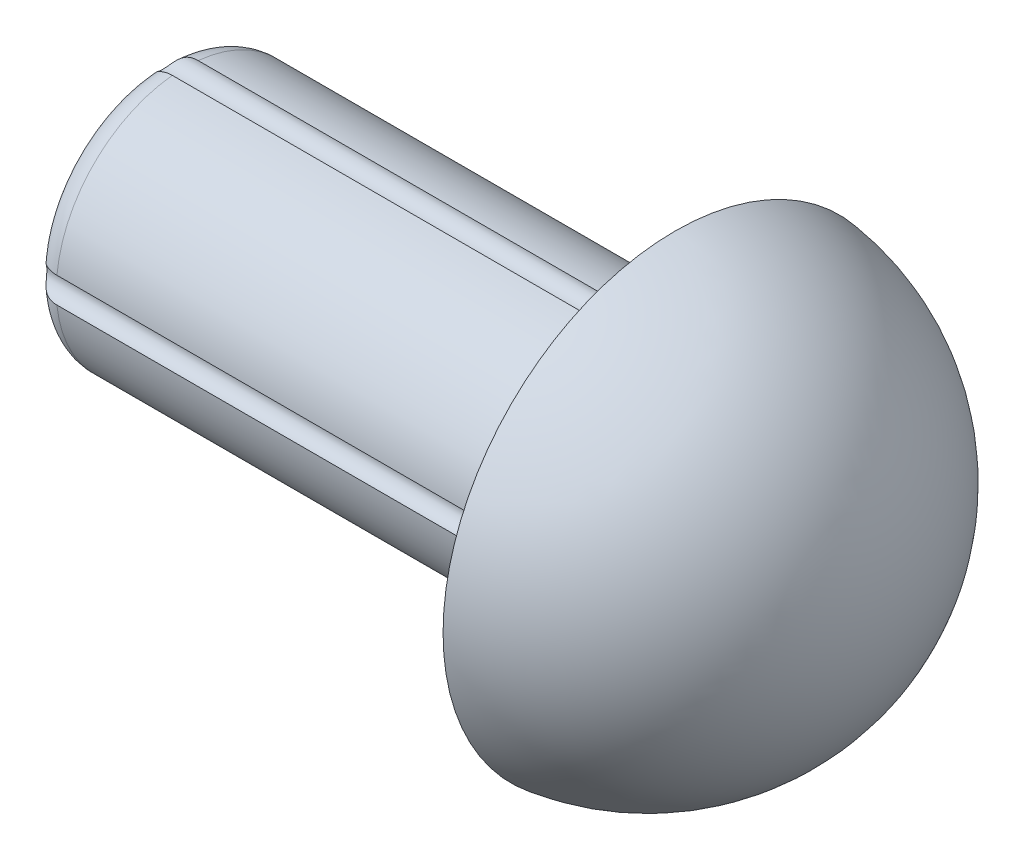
ISO-10303-21;
HEADER;
FILE_DESCRIPTION(('STEP AP214'),'2;1');
FILE_NAME('part.step','',(''),(''),'','','');
FILE_SCHEMA(('AUTOMOTIVE_DESIGN { 1 0 10303 214 1 1 1 1 }'));
ENDSEC;
DATA;
#1=APPLICATION_CONTEXT('core data for automotive mechanical design processes');
#2=APPLICATION_PROTOCOL_DEFINITION('international standard','automotive_design',2000,#1);
#3=PRODUCT_CONTEXT('',#1,'mechanical');
#4=PRODUCT('Part','Part','',(#3));
#5=PRODUCT_RELATED_PRODUCT_CATEGORY('part','',(#4));
#6=PRODUCT_DEFINITION_FORMATION('','',#4);
#7=PRODUCT_DEFINITION_CONTEXT('part definition',#1,'design');
#8=PRODUCT_DEFINITION('design','',#6,#7);
#9=PRODUCT_DEFINITION_SHAPE('','',#8);
#10=(LENGTH_UNIT() NAMED_UNIT(*) SI_UNIT(.MILLI.,.METRE.));
#11=(NAMED_UNIT(*) PLANE_ANGLE_UNIT() SI_UNIT($,.RADIAN.));
#12=(NAMED_UNIT(*) SI_UNIT($,.STERADIAN.) SOLID_ANGLE_UNIT());
#13=UNCERTAINTY_MEASURE_WITH_UNIT(LENGTH_MEASURE(1.E-05),#10,'distance_accuracy_value','');
#14=(GEOMETRIC_REPRESENTATION_CONTEXT(3) GLOBAL_UNCERTAINTY_ASSIGNED_CONTEXT((#13)) GLOBAL_UNIT_ASSIGNED_CONTEXT((#10,
#11,#12)) REPRESENTATION_CONTEXT('',''));
#15=CARTESIAN_POINT('',(0.,0.,0.));
#16=DIRECTION('',(0.,0.,1.));
#17=DIRECTION('',(1.,0.,0.));
#18=AXIS2_PLACEMENT_3D('',#15,#16,#17);
#19=CARTESIAN_POINT('',(0.499999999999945,0.,0.));
#20=DIRECTION('',(-1.,0.,0.));
#21=DIRECTION('',(0.,0.,1.));
#22=AXIS2_PLACEMENT_3D('',#19,#20,#21);
#23=TOROIDAL_SURFACE('',#22,2.,0.5);
#24=CARTESIAN_POINT('',(0.,0.,0.));
#25=DIRECTION('',(-1.,0.,0.));
#26=DIRECTION('',(0.,0.,1.));
#27=AXIS2_PLACEMENT_3D('',#24,#25,#26);
#28=CIRCLE('',#27,2.);
#29=CARTESIAN_POINT('',(0.,0.,2.));
#30=VERTEX_POINT('',#29);
#31=EDGE_CURVE('E11',#30,#30,#28,.T.);
#32=ORIENTED_EDGE('',*,*,#31,.F.);
#33=EDGE_LOOP('',(#32));
#34=FACE_BOUND('',#33,.T.);
#35=CARTESIAN_POINT('',(0.499999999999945,0.,0.));
#36=DIRECTION('',(-1.,0.,0.));
#37=DIRECTION('',(0.,0.,1.));
#38=AXIS2_PLACEMENT_3D('',#35,#36,#37);
#39=CIRCLE('',#38,2.5);
#40=CARTESIAN_POINT('',(0.499999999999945,-2.48749999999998,0.249687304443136));
#41=VERTEX_POINT('',#40);
#42=CARTESIAN_POINT('',(0.500000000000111,-0.249687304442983,2.4875000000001));
#43=VERTEX_POINT('',#42);
#44=EDGE_CURVE('E131',#41,#43,#39,.T.);
#45=ORIENTED_EDGE('',*,*,#44,.T.);
#46=CARTESIAN_POINT('',(0.500200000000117,-0.249687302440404,2.4874999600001));
#47=CARTESIAN_POINT('',(0.486191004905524,-0.249678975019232,2.48750780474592));
#48=CARTESIAN_POINT('',(0.472182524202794,-0.249658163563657,2.48692246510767));
#49=CARTESIAN_POINT('',(0.444260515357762,-0.249529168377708,2.48458176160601));
#50=CARTESIAN_POINT('',(0.430347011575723,-0.249420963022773,2.48282610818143));
#51=CARTESIAN_POINT('',(0.402639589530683,-0.24905370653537,2.47814824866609));
#52=CARTESIAN_POINT('',(0.388846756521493,-0.248793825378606,2.47521965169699));
#53=CARTESIAN_POINT('',(0.361564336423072,-0.247998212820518,2.46823239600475));
#54=CARTESIAN_POINT('',(0.348074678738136,-0.24746254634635,2.46417400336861));
#55=CARTESIAN_POINT('',(0.312853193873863,-0.245467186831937,2.45198002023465));
#56=CARTESIAN_POINT('',(0.291455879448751,-0.243633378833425,2.44290796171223));
#57=CARTESIAN_POINT('',(0.250321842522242,-0.237817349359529,2.4221653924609));
#58=CARTESIAN_POINT('',(0.230579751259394,-0.233842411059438,2.41050376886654));
#59=CARTESIAN_POINT('',(0.198954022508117,-0.224232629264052,2.38903493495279));
#60=CARTESIAN_POINT('',(0.1864845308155,-0.219448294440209,2.37971433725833));
#61=CARTESIAN_POINT('',(0.162991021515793,-0.207799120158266,2.36055571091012));
#62=CARTESIAN_POINT('',(0.151965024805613,-0.200937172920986,2.35071841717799));
#63=CARTESIAN_POINT('',(0.133469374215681,-0.186225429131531,2.33287976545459));
#64=CARTESIAN_POINT('',(0.125715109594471,-0.178759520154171,2.32485879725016));
#65=CARTESIAN_POINT('',(0.111579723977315,-0.162134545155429,2.30936635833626));
#66=CARTESIAN_POINT('',(0.105198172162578,-0.15297601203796,2.30189471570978));
#67=CARTESIAN_POINT('',(0.0938821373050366,-0.133019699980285,2.28797548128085));
#68=CARTESIAN_POINT('',(0.0889554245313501,-0.122213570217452,2.28153346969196));
#69=CARTESIAN_POINT('',(0.0806137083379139,-0.0992795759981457,2.27020233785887));
#70=CARTESIAN_POINT('',(0.0771984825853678,-0.0871519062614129,2.26531298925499));
#71=CARTESIAN_POINT('',(0.0720879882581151,-0.0631773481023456,2.25781951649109));
#72=CARTESIAN_POINT('',(0.0702609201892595,-0.0514117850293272,2.25504340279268));
#73=CARTESIAN_POINT('',(0.0677661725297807,-0.0274837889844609,2.25122034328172));
#74=CARTESIAN_POINT('',(0.0670982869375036,-0.0153214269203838,2.25017309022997));
#75=CARTESIAN_POINT('',(0.066904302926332,0.00870800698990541,2.2498705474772));
#76=CARTESIAN_POINT('',(0.0673481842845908,0.0205742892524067,2.25056814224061));
#77=CARTESIAN_POINT('',(0.0693277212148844,0.0439975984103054,2.25361891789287));
#78=CARTESIAN_POINT('',(0.0708632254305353,0.055554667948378,2.2559718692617));
#79=CARTESIAN_POINT('',(0.0750602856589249,0.0780230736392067,2.26220141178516));
#80=CARTESIAN_POINT('',(0.0777207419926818,0.0889350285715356,2.26607651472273));
#81=CARTESIAN_POINT('',(0.0842032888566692,0.109830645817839,2.27512918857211));
#82=CARTESIAN_POINT('',(0.0880252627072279,0.119814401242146,2.28030662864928));
#83=CARTESIAN_POINT('',(0.0969069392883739,0.138771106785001,2.29175229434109));
#84=CARTESIAN_POINT('',(0.101984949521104,0.147725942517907,2.29803621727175));
#85=CARTESIAN_POINT('',(0.113302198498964,0.164301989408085,2.31127391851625));
#86=CARTESIAN_POINT('',(0.119541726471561,0.171922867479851,2.31822786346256));
#87=CARTESIAN_POINT('',(0.133606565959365,0.186335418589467,2.3329862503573));
#88=CARTESIAN_POINT('',(0.141516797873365,0.193018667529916,2.3408150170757));
#89=CARTESIAN_POINT('',(0.15840913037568,0.204900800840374,2.35643079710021));
#90=CARTESIAN_POINT('',(0.167391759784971,0.210098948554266,2.36421778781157));
#91=CARTESIAN_POINT('',(0.191476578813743,0.221702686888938,2.38364811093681));
#92=CARTESIAN_POINT('',(0.207219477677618,0.227190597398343,2.39504711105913));
#93=CARTESIAN_POINT('',(0.240337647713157,0.235843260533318,2.41627419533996));
#94=CARTESIAN_POINT('',(0.257717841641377,0.239000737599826,2.42609728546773));
#95=CARTESIAN_POINT('',(0.299652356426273,0.244557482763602,2.44669747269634));
#96=CARTESIAN_POINT('',(0.324666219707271,0.246352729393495,2.45670022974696));
#97=CARTESIAN_POINT('',(0.375978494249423,0.24863096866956,2.47265178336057));
#98=CARTESIAN_POINT('',(0.402275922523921,0.249114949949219,2.47860363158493));
#99=CARTESIAN_POINT('',(0.440683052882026,0.249499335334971,2.48411498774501));
#100=CARTESIAN_POINT('',(0.45256491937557,0.249574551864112,2.48538890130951));
#101=CARTESIAN_POINT('',(0.476363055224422,0.249667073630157,2.48708292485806));
#102=CARTESIAN_POINT('',(0.488279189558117,0.249684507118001,2.48750492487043));
#103=CARTESIAN_POINT('',(0.500200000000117,0.249687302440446,2.48749996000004));
#104=B_SPLINE_CURVE_WITH_KNOTS('',3,(#46,#47,#48,#49,#50,#51,#52,#53,#54,#55,#56,#57,#58,#59,
#60,#61,#62,#63,#64,#65,#66,#67,#68,#69,#70,#71,#72,#73,#74,#75,#76,#77,#78,#79,#80,#81,#82,#83,
#84,#85,#86,#87,#88,#89,#90,#91,#92,#93,#94,#95,#96,#97,#98,#99,#100,#101,#102,#103),
.UNSPECIFIED.,.F.,.F.,(4,2,2,2,2,2,2,2,2,2,2,2,2,2,2,2,2,2,2,2,2,2,2,2,2,2,2,2,4),(0.,
0.0420132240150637,0.0840368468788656,0.126292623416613,0.168538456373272,0.238210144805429,
0.307646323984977,0.356341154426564,0.404968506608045,0.44507364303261,0.485166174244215,
0.525469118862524,0.565766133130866,0.602263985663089,0.638755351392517,0.674272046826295,
0.709783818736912,0.745260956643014,0.780734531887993,0.816759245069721,0.852792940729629,
0.89159026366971,0.930406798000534,0.990652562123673,1.05108562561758,1.13167263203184,
1.2121988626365,1.24802359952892,1.28376876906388),.UNSPECIFIED.);
#105=CARTESIAN_POINT('',(0.500000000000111,0.249687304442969,2.48750000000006));
#106=VERTEX_POINT('',#105);
#107=EDGE_CURVE('E47',#43,#106,#104,.T.);
#108=ORIENTED_EDGE('',*,*,#107,.T.);
#109=CARTESIAN_POINT('',(0.500000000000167,2.48749999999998,0.249687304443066));
#110=VERTEX_POINT('',#109);
#111=EDGE_CURVE('E111',#106,#110,#39,.T.);
#112=ORIENTED_EDGE('',*,*,#111,.T.);
#113=CARTESIAN_POINT('',(0.500200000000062,2.48749995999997,0.249687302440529));
#114=CARTESIAN_POINT('',(0.48619100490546,2.48750780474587,0.249678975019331));
#115=CARTESIAN_POINT('',(0.472182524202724,2.48692246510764,0.249658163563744));
#116=CARTESIAN_POINT('',(0.444260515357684,2.484581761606,0.249529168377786));
#117=CARTESIAN_POINT('',(0.430347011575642,2.48282610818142,0.249420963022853));
#118=CARTESIAN_POINT('',(0.402639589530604,2.47814824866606,0.249053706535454));
#119=CARTESIAN_POINT('',(0.388846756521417,2.47521965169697,0.248793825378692));
#120=CARTESIAN_POINT('',(0.361564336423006,2.46823239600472,0.247998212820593));
#121=CARTESIAN_POINT('',(0.348074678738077,2.46417400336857,0.247462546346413));
#122=CARTESIAN_POINT('',(0.31285319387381,2.4519800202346,0.24546718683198));
#123=CARTESIAN_POINT('',(0.291455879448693,2.4429079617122,0.243633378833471));
#124=CARTESIAN_POINT('',(0.250321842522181,2.42216539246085,0.237817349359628));
#125=CARTESIAN_POINT('',(0.230579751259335,2.41050376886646,0.233842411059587));
#126=CARTESIAN_POINT('',(0.19895402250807,2.38903493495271,0.224232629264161));
#127=CARTESIAN_POINT('',(0.186484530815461,2.37971433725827,0.219448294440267));
#128=CARTESIAN_POINT('',(0.162991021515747,2.36055571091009,0.207799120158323));
#129=CARTESIAN_POINT('',(0.151965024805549,2.35071841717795,0.200937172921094));
#130=CARTESIAN_POINT('',(0.133469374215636,2.33287976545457,0.186225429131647));
#131=CARTESIAN_POINT('',(0.125715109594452,2.32485879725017,0.17875952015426));
#132=CARTESIAN_POINT('',(0.111579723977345,2.30936635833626,0.162134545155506));
#133=CARTESIAN_POINT('',(0.10519817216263,2.30189471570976,0.15297601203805));
#134=CARTESIAN_POINT('',(0.0938821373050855,2.28797548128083,0.133019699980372));
#135=CARTESIAN_POINT('',(0.0889554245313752,2.28153346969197,0.12221357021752));
#136=CARTESIAN_POINT('',(0.0806137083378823,2.27020233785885,0.0992795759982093));
#137=CARTESIAN_POINT('',(0.0771984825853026,2.26531298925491,0.0871519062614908));
#138=CARTESIAN_POINT('',(0.072087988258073,2.25781951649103,0.063177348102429));
#139=CARTESIAN_POINT('',(0.0702609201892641,2.25504340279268,0.0514117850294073));
#140=CARTESIAN_POINT('',(0.0677661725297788,2.25122034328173,0.027483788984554));
#141=CARTESIAN_POINT('',(0.0670982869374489,2.25017309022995,0.0153214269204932));
#142=CARTESIAN_POINT('',(0.0669043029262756,2.24987054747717,-0.00870800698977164));
#143=CARTESIAN_POINT('',(0.0673481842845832,2.25056814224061,-0.0205742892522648));
#144=CARTESIAN_POINT('',(0.0693277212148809,2.25361891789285,-0.0439975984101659));
#145=CARTESIAN_POINT('',(0.0708632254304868,2.25597186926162,-0.0555546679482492));
#146=CARTESIAN_POINT('',(0.0750602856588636,2.26220141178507,-0.0780230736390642));
#147=CARTESIAN_POINT('',(0.077720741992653,2.26607651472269,-0.0889350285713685));
#148=CARTESIAN_POINT('',(0.0842032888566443,2.27512918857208,-0.109830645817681));
#149=CARTESIAN_POINT('',(0.0880252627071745,2.28030662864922,-0.11981440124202));
#150=CARTESIAN_POINT('',(0.096906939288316,2.29175229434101,-0.138771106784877));
#151=CARTESIAN_POINT('',(0.10198494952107,2.29803621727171,-0.147725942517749));
#152=CARTESIAN_POINT('',(0.11330219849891,2.31127391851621,-0.164301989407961));
#153=CARTESIAN_POINT('',(0.119541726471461,2.31822786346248,-0.171922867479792));
#154=CARTESIAN_POINT('',(0.133606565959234,2.3329862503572,-0.186335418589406));
#155=CARTESIAN_POINT('',(0.141516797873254,2.34081501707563,-0.193018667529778));
#156=CARTESIAN_POINT('',(0.158409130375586,2.35643079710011,-0.204900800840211));
#157=CARTESIAN_POINT('',(0.167391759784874,2.36421778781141,-0.210098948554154));
#158=CARTESIAN_POINT('',(0.191476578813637,2.38364811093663,-0.221702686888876));
#159=CARTESIAN_POINT('',(0.207219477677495,2.39504711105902,-0.227190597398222));
#160=CARTESIAN_POINT('',(0.240337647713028,2.41627419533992,-0.235843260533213));
#161=CARTESIAN_POINT('',(0.257717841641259,2.42609728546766,-0.239000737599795));
#162=CARTESIAN_POINT('',(0.299652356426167,2.44669747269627,-0.244557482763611));
#163=CARTESIAN_POINT('',(0.324666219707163,2.45670022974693,-0.246352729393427));
#164=CARTESIAN_POINT('',(0.375978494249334,2.47265178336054,-0.248630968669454));
#165=CARTESIAN_POINT('',(0.402275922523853,2.47860363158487,-0.249114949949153));
#166=CARTESIAN_POINT('',(0.440683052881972,2.48411498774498,-0.2494993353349));
#167=CARTESIAN_POINT('',(0.452564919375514,2.48538890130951,-0.249574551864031));
#168=CARTESIAN_POINT('',(0.476363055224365,2.48708292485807,-0.249667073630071));
#169=CARTESIAN_POINT('',(0.488279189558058,2.48750492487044,-0.249684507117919));
#170=CARTESIAN_POINT('',(0.500200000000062,2.48749996,-0.249687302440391));
#171=B_SPLINE_CURVE_WITH_KNOTS('',3,(#113,#114,#115,#116,#117,#118,#119,#120,#121,#122,#123,
#124,#125,#126,#127,#128,#129,#130,#131,#132,#133,#134,#135,#136,#137,#138,#139,#140,#141,#142,
#143,#144,#145,#146,#147,#148,#149,#150,#151,#152,#153,#154,#155,#156,#157,#158,#159,#160,#161,
#162,#163,#164,#165,#166,#167,#168,#169,#170),.UNSPECIFIED.,.F.,.F.,(4,2,2,2,2,2,2,2,2,2,2,2,2,
2,2,2,2,2,2,2,2,2,2,2,2,2,2,2,4),(0.,0.0420132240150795,0.0840368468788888,0.126292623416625,
0.168538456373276,0.238210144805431,0.307646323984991,0.356341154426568,0.404968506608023,
0.44507364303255,0.485166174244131,0.525469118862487,0.565766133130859,0.602263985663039,
0.638755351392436,0.674272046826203,0.709783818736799,0.745260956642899,0.780734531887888,
0.816759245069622,0.852792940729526,0.891590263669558,0.930406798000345,0.990652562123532,
1.05108562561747,1.13167263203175,1.21219886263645,1.24802359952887,1.28376876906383),.UNSPECIFIED.);
#172=CARTESIAN_POINT('',(0.500000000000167,2.4875,-0.249687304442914));
#173=VERTEX_POINT('',#172);
#174=EDGE_CURVE('E185',#110,#173,#171,.T.);
#175=ORIENTED_EDGE('',*,*,#174,.T.);
#176=CARTESIAN_POINT('',(0.499999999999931,0.249687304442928,-2.48749999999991));
#177=VERTEX_POINT('',#176);
#178=EDGE_CURVE('E40',#173,#177,#39,.T.);
#179=ORIENTED_EDGE('',*,*,#178,.T.);
#180=CARTESIAN_POINT('',(0.500199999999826,0.24968730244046,-2.48749995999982));
#181=CARTESIAN_POINT('',(0.486191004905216,0.249678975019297,-2.48750780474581));
#182=CARTESIAN_POINT('',(0.472182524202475,0.24965816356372,-2.48692246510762));
#183=CARTESIAN_POINT('',(0.444260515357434,0.249529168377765,-2.48458176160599));
#184=CARTESIAN_POINT('',(0.430347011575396,0.249420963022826,-2.48282610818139));
#185=CARTESIAN_POINT('',(0.402639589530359,0.249053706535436,-2.47814824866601));
#186=CARTESIAN_POINT('',(0.38884675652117,0.248793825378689,-2.47521965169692));
#187=CARTESIAN_POINT('',(0.361564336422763,0.247998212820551,-2.46823239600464));
#188=CARTESIAN_POINT('',(0.348074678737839,0.247462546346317,-2.46417400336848));
#189=CARTESIAN_POINT('',(0.312853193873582,0.245467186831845,-2.45198002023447));
#190=CARTESIAN_POINT('',(0.291455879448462,0.243633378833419,-2.44290796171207));
#191=CARTESIAN_POINT('',(0.250321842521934,0.23781734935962,-2.42216539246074));
#192=CARTESIAN_POINT('',(0.230579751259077,0.233842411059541,-2.41050376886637));
#193=CARTESIAN_POINT('',(0.198954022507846,0.224232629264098,-2.38903493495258));
#194=CARTESIAN_POINT('',(0.186484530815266,0.21944829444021,-2.3797143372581));
#195=CARTESIAN_POINT('',(0.162991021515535,0.207799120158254,-2.36055571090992));
#196=CARTESIAN_POINT('',(0.151965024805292,0.200937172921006,-2.35071841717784));
#197=CARTESIAN_POINT('',(0.133469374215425,0.186225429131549,-2.33287976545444));
#198=CARTESIAN_POINT('',(0.12571510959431,0.178759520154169,-2.32485879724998));
#199=CARTESIAN_POINT('',(0.111579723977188,0.162134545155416,-2.30936635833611));
#200=CARTESIAN_POINT('',(0.10519817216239,0.152976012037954,-2.3018947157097));
#201=CARTESIAN_POINT('',(0.0938821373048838,0.133019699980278,-2.28797548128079));
#202=CARTESIAN_POINT('',(0.0889554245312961,0.122213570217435,-2.28153346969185));
#203=CARTESIAN_POINT('',(0.0806137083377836,0.0992795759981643,-2.27020233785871));
#204=CARTESIAN_POINT('',(0.0771984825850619,0.0871519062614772,-2.26531298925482));
#205=CARTESIAN_POINT('',(0.0720879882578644,0.0631773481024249,-2.25781951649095));
#206=CARTESIAN_POINT('',(0.0702609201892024,0.0514117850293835,-2.25504340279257));
#207=CARTESIAN_POINT('',(0.0677661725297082,0.0274837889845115,-2.25122034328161));
#208=CARTESIAN_POINT('',(0.0670982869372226,0.0153214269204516,-2.25017309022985));
#209=CARTESIAN_POINT('',(0.0669043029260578,-0.00870800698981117,-2.24987054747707));
#210=CARTESIAN_POINT('',(0.067348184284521,-0.0205742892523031,-2.25056814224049));
#211=CARTESIAN_POINT('',(0.0693277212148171,-0.04399759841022,-2.25361891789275));
#212=CARTESIAN_POINT('',(0.0708632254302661,-0.0555546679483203,-2.25597186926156));
#213=CARTESIAN_POINT('',(0.0750602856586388,-0.0780230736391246,-2.26220141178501));
#214=CARTESIAN_POINT('',(0.0777207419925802,-0.0889350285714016,-2.26607651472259));
#215=CARTESIAN_POINT('',(0.0842032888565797,-0.109830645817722,-2.27512918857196));
#216=CARTESIAN_POINT('',(0.088025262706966,-0.119814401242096,-2.28030662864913));
#217=CARTESIAN_POINT('',(0.0969069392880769,-0.138771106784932,-2.2917522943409));
#218=CARTESIAN_POINT('',(0.101984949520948,-0.14772594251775,-2.29803621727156));
#219=CARTESIAN_POINT('',(0.1133021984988,-0.164301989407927,-2.31127391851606));
#220=CARTESIAN_POINT('',(0.119541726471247,-0.171922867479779,-2.31822786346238));
#221=CARTESIAN_POINT('',(0.133606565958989,-0.186335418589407,-2.3329862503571));
#222=CARTESIAN_POINT('',(0.141516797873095,-0.193018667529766,-2.34081501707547));
#223=CARTESIAN_POINT('',(0.158409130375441,-0.20490080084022,-2.35643079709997));
#224=CARTESIAN_POINT('',(0.167391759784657,-0.210098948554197,-2.36421778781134));
#225=CARTESIAN_POINT('',(0.191476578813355,-0.221702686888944,-2.38364811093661));
#226=CARTESIAN_POINT('',(0.20721947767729,-0.227190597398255,-2.39504711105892));
#227=CARTESIAN_POINT('',(0.240337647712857,-0.235843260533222,-2.41627419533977));
#228=CARTESIAN_POINT('',(0.257717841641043,-0.239000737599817,-2.42609728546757));
#229=CARTESIAN_POINT('',(0.299652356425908,-0.244557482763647,-2.44669747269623));
#230=CARTESIAN_POINT('',(0.324666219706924,-0.246352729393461,-2.45670022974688));
#231=CARTESIAN_POINT('',(0.375978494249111,-0.248630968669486,-2.47265178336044));
#232=CARTESIAN_POINT('',(0.402275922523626,-0.249114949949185,-2.47860363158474));
#233=CARTESIAN_POINT('',(0.440683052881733,-0.249499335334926,-2.48411498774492));
#234=CARTESIAN_POINT('',(0.452564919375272,-0.249574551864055,-2.48538890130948));
#235=CARTESIAN_POINT('',(0.476363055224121,-0.249667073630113,-2.48708292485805));
#236=CARTESIAN_POINT('',(0.488279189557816,-0.249684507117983,-2.4875049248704));
#237=CARTESIAN_POINT('',(0.500199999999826,-0.249687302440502,-2.48749995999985));
#238=B_SPLINE_CURVE_WITH_KNOTS('',3,(#180,#181,#182,#183,#184,#185,#186,#187,#188,#189,#190,
#191,#192,#193,#194,#195,#196,#197,#198,#199,#200,#201,#202,#203,#204,#205,#206,#207,#208,#209,
#210,#211,#212,#213,#214,#215,#216,#217,#218,#219,#220,#221,#222,#223,#224,#225,#226,#227,#228,
#229,#230,#231,#232,#233,#234,#235,#236,#237),.UNSPECIFIED.,.F.,.F.,(4,2,2,2,2,2,2,2,2,2,2,2,2,
2,2,2,2,2,2,2,2,2,2,2,2,2,2,2,4),(0.,0.0420132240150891,0.084036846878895,0.126292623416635,
0.168538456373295,0.23821014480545,0.307646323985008,0.356341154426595,0.40496850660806,
0.445073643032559,0.485166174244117,0.525469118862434,0.565766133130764,0.602263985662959,
0.638755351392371,0.674272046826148,0.709783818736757,0.745260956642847,0.780734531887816,
0.816759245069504,0.852792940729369,0.891590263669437,0.930406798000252,0.990652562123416,
1.05108562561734,1.13167263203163,1.21219886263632,1.24802359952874,1.2837687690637),.UNSPECIFIED.);
#239=CARTESIAN_POINT('',(0.499999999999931,-0.249687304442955,-2.48749999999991));
#240=VERTEX_POINT('',#239);
#241=EDGE_CURVE('E173',#177,#240,#238,.T.);
#242=ORIENTED_EDGE('',*,*,#241,.T.);
#243=CARTESIAN_POINT('',(0.499999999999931,-2.4875,-0.249687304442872));
#244=VERTEX_POINT('',#243);
#245=EDGE_CURVE('E205',#240,#244,#39,.T.);
#246=ORIENTED_EDGE('',*,*,#245,.T.);
#247=CARTESIAN_POINT('',(0.500199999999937,-2.48749996,-0.249687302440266));
#248=CARTESIAN_POINT('',(0.486191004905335,-2.48750780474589,-0.249678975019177));
#249=CARTESIAN_POINT('',(0.472182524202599,-2.48692246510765,-0.249658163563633));
#250=CARTESIAN_POINT('',(0.444260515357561,-2.484581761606,-0.249529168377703));
#251=CARTESIAN_POINT('',(0.430347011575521,-2.48282610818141,-0.249420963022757));
#252=CARTESIAN_POINT('',(0.402639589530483,-2.47814824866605,-0.249053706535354));
#253=CARTESIAN_POINT('',(0.388846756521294,-2.47521965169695,-0.248793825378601));
#254=CARTESIAN_POINT('',(0.361564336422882,-2.46823239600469,-0.247998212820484));
#255=CARTESIAN_POINT('',(0.348074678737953,-2.46417400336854,-0.247462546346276));
#256=CARTESIAN_POINT('',(0.312853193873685,-2.45198002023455,-0.245467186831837));
#257=CARTESIAN_POINT('',(0.291455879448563,-2.44290796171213,-0.243633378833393));
#258=CARTESIAN_POINT('',(0.250321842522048,-2.42216539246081,-0.237817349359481));
#259=CARTESIAN_POINT('',(0.230579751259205,-2.41050376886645,-0.233842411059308));
#260=CARTESIAN_POINT('',(0.198954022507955,-2.38903493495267,-0.22423262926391));
#261=CARTESIAN_POINT('',(0.186484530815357,-2.37971433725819,-0.219448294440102));
#262=CARTESIAN_POINT('',(0.162991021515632,-2.36055571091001,-0.207799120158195));
#263=CARTESIAN_POINT('',(0.151965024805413,-2.35071841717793,-0.200937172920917));
#264=CARTESIAN_POINT('',(0.133469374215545,-2.33287976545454,-0.186225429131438));
#265=CARTESIAN_POINT('',(0.125715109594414,-2.32485879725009,-0.178759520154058));
#266=CARTESIAN_POINT('',(0.111579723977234,-2.30936635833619,-0.162134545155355));
#267=CARTESIAN_POINT('',(0.105198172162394,-2.30189471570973,-0.152976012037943));
#268=CARTESIAN_POINT('',(0.093882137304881,-2.28797548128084,-0.133019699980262));
#269=CARTESIAN_POINT('',(0.0889554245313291,-2.28153346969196,-0.122213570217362));
#270=CARTESIAN_POINT('',(0.0806137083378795,-2.2702023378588,-0.0992795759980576));
#271=CARTESIAN_POINT('',(0.0771984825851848,-2.26531298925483,-0.0871519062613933));
#272=CARTESIAN_POINT('',(0.0720879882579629,-2.25781951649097,-0.0631773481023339));
#273=CARTESIAN_POINT('',(0.0702609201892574,-2.25504340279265,-0.051411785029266));
#274=CARTESIAN_POINT('',(0.0677661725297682,-2.25122034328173,-0.0274837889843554));
#275=CARTESIAN_POINT('',(0.0670982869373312,-2.25017309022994,-0.0153214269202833));
#276=CARTESIAN_POINT('',(0.0669043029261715,-2.24987054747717,0.00870800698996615));
#277=CARTESIAN_POINT('',(0.0673481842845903,-2.25056814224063,0.0205742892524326));
#278=CARTESIAN_POINT('',(0.0693277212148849,-2.25361891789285,0.0439975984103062));
#279=CARTESIAN_POINT('',(0.0708632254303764,-2.2559718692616,0.0555546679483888));
#280=CARTESIAN_POINT('',(0.0750602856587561,-2.26220141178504,0.0780230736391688));
#281=CARTESIAN_POINT('',(0.0777207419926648,-2.26607651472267,0.0889350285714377));
#282=CARTESIAN_POINT('',(0.0842032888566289,-2.27512918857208,0.109830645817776));
#283=CARTESIAN_POINT('',(0.0880252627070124,-2.28030662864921,0.119814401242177));
#284=CARTESIAN_POINT('',(0.0969069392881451,-2.29175229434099,0.138771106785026));
#285=CARTESIAN_POINT('',(0.101984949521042,-2.29803621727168,0.147725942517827));
#286=CARTESIAN_POINT('',(0.113302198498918,-2.3112739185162,0.164301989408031));
#287=CARTESIAN_POINT('',(0.119541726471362,-2.31822786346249,0.171922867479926));
#288=CARTESIAN_POINT('',(0.133606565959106,-2.33298625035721,0.186335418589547));
#289=CARTESIAN_POINT('',(0.141516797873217,-2.3408150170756,0.193018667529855));
#290=CARTESIAN_POINT('',(0.15840913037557,-2.35643079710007,0.204900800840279));
#291=CARTESIAN_POINT('',(0.167391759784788,-2.3642177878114,0.210098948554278));
#292=CARTESIAN_POINT('',(0.191476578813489,-2.38364811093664,0.221702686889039));
#293=CARTESIAN_POINT('',(0.207219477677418,-2.39504711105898,0.227190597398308));
#294=CARTESIAN_POINT('',(0.240337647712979,-2.41627419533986,0.235843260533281));
#295=CARTESIAN_POINT('',(0.257717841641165,-2.42609728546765,0.239000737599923));
#296=CARTESIAN_POINT('',(0.299652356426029,-2.44669747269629,0.244557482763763));
#297=CARTESIAN_POINT('',(0.324666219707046,-2.45670022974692,0.246352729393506));
#298=CARTESIAN_POINT('',(0.375978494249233,-2.47265178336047,0.248630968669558));
#299=CARTESIAN_POINT('',(0.402275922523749,-2.47860363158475,0.249114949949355));
#300=CARTESIAN_POINT('',(0.440683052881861,-2.48411498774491,0.249499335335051));
#301=CARTESIAN_POINT('',(0.452564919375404,-2.48538890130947,0.24957455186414));
#302=CARTESIAN_POINT('',(0.476363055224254,-2.48708292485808,0.249667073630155));
#303=CARTESIAN_POINT('',(0.488279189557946,-2.48750492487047,0.249684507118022));
#304=CARTESIAN_POINT('',(0.500199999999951,-2.48749996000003,0.249687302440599));
#305=B_SPLINE_CURVE_WITH_KNOTS('',3,(#247,#248,#249,#250,#251,#252,#253,#254,#255,#256,#257,
#258,#259,#260,#261,#262,#263,#264,#265,#266,#267,#268,#269,#270,#271,#272,#273,#274,#275,#276,
#277,#278,#279,#280,#281,#282,#283,#284,#285,#286,#287,#288,#289,#290,#291,#292,#293,#294,#295,
#296,#297,#298,#299,#300,#301,#302,#303,#304),.UNSPECIFIED.,.F.,.F.,(4,2,2,2,2,2,2,2,2,2,2,2,2,
2,2,2,2,2,2,2,2,2,2,2,2,2,2,2,4),(0.,0.0420132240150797,0.0840368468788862,0.126292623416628,
0.168538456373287,0.238210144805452,0.30764632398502,0.356341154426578,0.404968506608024,
0.445073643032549,0.485166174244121,0.525469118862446,0.565766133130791,0.602263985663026,
0.638755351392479,0.674272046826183,0.709783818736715,0.745260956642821,0.780734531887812,
0.816759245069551,0.852792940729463,0.891590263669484,0.930406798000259,0.990652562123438,
1.05108562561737,1.13167263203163,1.21219886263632,1.24802359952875,1.28376876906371),.UNSPECIFIED.);
#306=EDGE_CURVE('E55',#244,#41,#305,.T.);
#307=ORIENTED_EDGE('',*,*,#306,.T.);
#308=EDGE_LOOP('',(#45,#108,#112,#175,#179,#242,#246,#307));
#309=FACE_BOUND('',#308,.T.);
#310=ADVANCED_FACE('F32',(#34,#309),#23,.T.);
#311=CARTESIAN_POINT('',(0.,0.,0.));
#312=DIRECTION('',(-1.,0.,0.));
#313=DIRECTION('',(0.,0.,1.));
#314=AXIS2_PLACEMENT_3D('',#311,#312,#313);
#315=CYLINDRICAL_SURFACE('',#314,2.5);
#316=ORIENTED_EDGE('',*,*,#111,.F.);
#317=DIRECTION('',(-1.,0.,0.));
#318=VECTOR('',#317,1.);
#319=CARTESIAN_POINT('',(5.00000000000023,0.249687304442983,2.48750000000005));
#320=LINE('',#319,#318);
#321=CARTESIAN_POINT('',(10.0000000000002,0.249687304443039,2.48750000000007));
#322=VERTEX_POINT('',#321);
#323=EDGE_CURVE('E98',#106,#322,#320,.F.);
#324=ORIENTED_EDGE('',*,*,#323,.T.);
#325=CARTESIAN_POINT('',(10.,0.,0.));
#326=DIRECTION('',(-1.,0.,0.));
#327=DIRECTION('',(0.,0.,1.));
#328=AXIS2_PLACEMENT_3D('',#325,#326,#327);
#329=CIRCLE('',#328,2.5);
#330=CARTESIAN_POINT('',(10.0000000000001,2.48749999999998,0.249687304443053));
#331=VERTEX_POINT('',#330);
#332=EDGE_CURVE('E109',#322,#331,#329,.T.);
#333=ORIENTED_EDGE('',*,*,#332,.T.);
#334=DIRECTION('',(-1.,0.,0.));
#335=VECTOR('',#334,1.);
#336=CARTESIAN_POINT('',(5.00000000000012,2.48750000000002,0.249687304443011));
#337=LINE('',#336,#335);
#338=EDGE_CURVE('E183',#331,#110,#337,.T.);
#339=ORIENTED_EDGE('',*,*,#338,.T.);
#340=EDGE_LOOP('',(#316,#324,#333,#339));
#341=FACE_BOUND('',#340,.T.);
#342=ADVANCED_FACE('F107',(#341),#315,.T.);
#343=CARTESIAN_POINT('',(10.,-2.4875,0.24968730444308));
#344=VERTEX_POINT('',#343);
#345=CARTESIAN_POINT('',(10.0000000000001,-0.249687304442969,2.48750000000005));
#346=VERTEX_POINT('',#345);
#347=EDGE_CURVE('E119',#344,#346,#329,.T.);
#348=ORIENTED_EDGE('',*,*,#347,.T.);
#349=DIRECTION('',(-1.,0.,0.));
#350=VECTOR('',#349,1.);
#351=CARTESIAN_POINT('',(5.00000000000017,-0.249687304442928,2.48750000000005));
#352=LINE('',#351,#350);
#353=EDGE_CURVE('E99',#346,#43,#352,.T.);
#354=ORIENTED_EDGE('',*,*,#353,.T.);
#355=ORIENTED_EDGE('',*,*,#44,.F.);
#356=DIRECTION('',(-1.,0.,0.));
#357=VECTOR('',#356,1.);
#358=CARTESIAN_POINT('',(5.,-2.48749999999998,0.249687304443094));
#359=LINE('',#358,#357);
#360=EDGE_CURVE('E154',#41,#344,#359,.F.);
#361=ORIENTED_EDGE('',*,*,#360,.T.);
#362=EDGE_LOOP('',(#348,#354,#355,#361));
#363=FACE_BOUND('',#362,.T.);
#364=ADVANCED_FACE('F204',(#363),#315,.T.);
#365=CARTESIAN_POINT('',(9.99999999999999,-0.249687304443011,-2.48749999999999));
#366=VERTEX_POINT('',#365);
#367=CARTESIAN_POINT('',(9.99999999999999,-2.48749999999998,-0.249687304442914));
#368=VERTEX_POINT('',#367);
#369=EDGE_CURVE('E123',#366,#368,#329,.T.);
#370=ORIENTED_EDGE('',*,*,#369,.T.);
#371=DIRECTION('',(-1.,0.,0.));
#372=VECTOR('',#371,1.);
#373=CARTESIAN_POINT('',(4.99999999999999,-2.48749999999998,-0.249687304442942));
#374=LINE('',#373,#372);
#375=EDGE_CURVE('E138',#368,#244,#374,.T.);
#376=ORIENTED_EDGE('',*,*,#375,.T.);
#377=ORIENTED_EDGE('',*,*,#245,.F.);
#378=DIRECTION('',(-1.,0.,0.));
#379=VECTOR('',#378,1.);
#380=CARTESIAN_POINT('',(4.99999999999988,-0.249687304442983,-2.48749999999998));
#381=LINE('',#380,#379);
#382=EDGE_CURVE('E140',#240,#366,#381,.F.);
#383=ORIENTED_EDGE('',*,*,#382,.T.);
#384=EDGE_LOOP('',(#370,#376,#377,#383));
#385=FACE_BOUND('',#384,.T.);
#386=ADVANCED_FACE('F136',(#385),#315,.T.);
#387=CARTESIAN_POINT('',(10.0000000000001,2.48750000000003,-0.249687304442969));
#388=VERTEX_POINT('',#387);
#389=CARTESIAN_POINT('',(9.99999999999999,0.249687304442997,-2.48749999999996));
#390=VERTEX_POINT('',#389);
#391=EDGE_CURVE('E122',#388,#390,#329,.T.);
#392=ORIENTED_EDGE('',*,*,#391,.T.);
#393=DIRECTION('',(-1.,0.,0.));
#394=VECTOR('',#393,1.);
#395=CARTESIAN_POINT('',(4.99999999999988,0.249687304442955,-2.48749999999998));
#396=LINE('',#395,#394);
#397=EDGE_CURVE('E180',#390,#177,#396,.T.);
#398=ORIENTED_EDGE('',*,*,#397,.T.);
#399=ORIENTED_EDGE('',*,*,#178,.F.);
#400=DIRECTION('',(-1.,0.,0.));
#401=VECTOR('',#400,1.);
#402=CARTESIAN_POINT('',(5.00000000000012,2.4875,-0.249687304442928));
#403=LINE('',#402,#401);
#404=EDGE_CURVE('E125',#173,#388,#403,.F.);
#405=ORIENTED_EDGE('',*,*,#404,.T.);
#406=EDGE_LOOP('',(#392,#398,#399,#405));
#407=FACE_BOUND('',#406,.T.);
#408=ADVANCED_FACE('F192',(#407),#315,.T.);
#409=CARTESIAN_POINT('',(1.11022302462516E-13,2.00000000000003,0.));
#410=DIRECTION('',(1.,0.,0.));
#411=DIRECTION('',(0.,0.,-1.));
#412=AXIS2_PLACEMENT_3D('',#409,#410,#411);
#413=PLANE('',#412);
#414=ORIENTED_EDGE('',*,*,#31,.T.);
#415=EDGE_LOOP('',(#414));
#416=FACE_BOUND('',#415,.T.);
#417=ADVANCED_FACE('F34',(#416),#413,.F.);
#418=CARTESIAN_POINT('',(10.0000000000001,2.50000000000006,0.));
#419=DIRECTION('',(-1.,0.,0.));
#420=DIRECTION('',(0.,0.,1.));
#421=AXIS2_PLACEMENT_3D('',#418,#419,#420);
#422=PLANE('',#421);
#423=ORIENTED_EDGE('',*,*,#332,.F.);
#424=CARTESIAN_POINT('',(10.0000000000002,0.,2.50000000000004));
#425=DIRECTION('',(-1.,0.,0.));
#426=DIRECTION('',(0.,-1.,0.));
#427=AXIS2_PLACEMENT_3D('',#424,#425,#426);
#428=CIRCLE('',#427,0.249999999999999);
#429=EDGE_CURVE('E95',#322,#346,#428,.T.);
#430=ORIENTED_EDGE('',*,*,#429,.T.);
#431=ORIENTED_EDGE('',*,*,#347,.F.);
#432=CARTESIAN_POINT('',(10.,-2.50000000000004,0.));
#433=DIRECTION('',(-1.,0.,0.));
#434=DIRECTION('',(0.,0.,-1.));
#435=AXIS2_PLACEMENT_3D('',#432,#433,#434);
#436=CIRCLE('',#435,0.249999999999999);
#437=EDGE_CURVE('E112',#344,#368,#436,.T.);
#438=ORIENTED_EDGE('',*,*,#437,.T.);
#439=ORIENTED_EDGE('',*,*,#369,.F.);
#440=CARTESIAN_POINT('',(9.99999999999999,0.,-2.49999999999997));
#441=DIRECTION('',(-1.,0.,0.));
#442=DIRECTION('',(0.,1.,0.));
#443=AXIS2_PLACEMENT_3D('',#440,#441,#442);
#444=CIRCLE('',#443,0.249999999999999);
#445=EDGE_CURVE('E143',#366,#390,#444,.T.);
#446=ORIENTED_EDGE('',*,*,#445,.T.);
#447=ORIENTED_EDGE('',*,*,#391,.F.);
#448=CARTESIAN_POINT('',(10.0000000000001,2.50000000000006,0.));
#449=DIRECTION('',(-1.,0.,0.));
#450=DIRECTION('',(0.,0.,1.));
#451=AXIS2_PLACEMENT_3D('',#448,#449,#450);
#452=CIRCLE('',#451,0.249999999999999);
#453=EDGE_CURVE('E118',#388,#331,#452,.T.);
#454=ORIENTED_EDGE('',*,*,#453,.T.);
#455=EDGE_LOOP('',(#423,#430,#431,#438,#439,#446,#447,#454));
#456=FACE_BOUND('',#455,.T.);
#457=CARTESIAN_POINT('',(10.,0.,0.));
#458=DIRECTION('',(-1.,0.,0.));
#459=DIRECTION('',(0.,0.,1.));
#460=AXIS2_PLACEMENT_3D('',#457,#458,#459);
#461=CIRCLE('',#460,4.5);
#462=CARTESIAN_POINT('',(10.,0.,4.50000000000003));
#463=VERTEX_POINT('',#462);
#464=EDGE_CURVE('E120',#463,#463,#461,.T.);
#465=ORIENTED_EDGE('',*,*,#464,.T.);
#466=EDGE_LOOP('',(#465));
#467=FACE_BOUND('',#466,.T.);
#468=ADVANCED_FACE('F115',(#456,#467),#422,.T.);
#469=CARTESIAN_POINT('',(9.46875000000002,0.,0.));
#470=DIRECTION('',(-1.,0.,0.));
#471=DIRECTION('',(0.,1.,0.));
#472=AXIS2_PLACEMENT_3D('',#469,#470,#471);
#473=SPHERICAL_SURFACE('',#472,4.53125);
#474=ORIENTED_EDGE('',*,*,#464,.F.);
#475=EDGE_LOOP('',(#474));
#476=FACE_BOUND('',#475,.T.);
#477=ADVANCED_FACE('F223',(#476),#473,.T.);
#478=CARTESIAN_POINT('',(1.11022302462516E-13,2.50000000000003,0.));
#479=DIRECTION('',(-1.,0.,0.));
#480=DIRECTION('',(0.,0.,1.));
#481=AXIS2_PLACEMENT_3D('',#478,#479,#480);
#482=CYLINDRICAL_SURFACE('',#481,0.249999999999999);
#483=ORIENTED_EDGE('',*,*,#174,.F.);
#484=ORIENTED_EDGE('',*,*,#338,.F.);
#485=ORIENTED_EDGE('',*,*,#453,.F.);
#486=ORIENTED_EDGE('',*,*,#404,.F.);
#487=EDGE_LOOP('',(#483,#484,#485,#486));
#488=FACE_BOUND('',#487,.T.);
#489=ADVANCED_FACE('F168',(#488),#482,.F.);
#490=CARTESIAN_POINT('',(-1.2490009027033E-13,0.,-2.49999999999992));
#491=DIRECTION('',(-1.,0.,0.));
#492=DIRECTION('',(0.,1.,0.));
#493=AXIS2_PLACEMENT_3D('',#490,#491,#492);
#494=CYLINDRICAL_SURFACE('',#493,0.249999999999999);
#495=ORIENTED_EDGE('',*,*,#241,.F.);
#496=ORIENTED_EDGE('',*,*,#397,.F.);
#497=ORIENTED_EDGE('',*,*,#445,.F.);
#498=ORIENTED_EDGE('',*,*,#382,.F.);
#499=EDGE_LOOP('',(#495,#496,#497,#498));
#500=FACE_BOUND('',#499,.T.);
#501=ADVANCED_FACE('F163',(#500),#494,.F.);
#502=CARTESIAN_POINT('',(0.,-2.50000000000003,0.));
#503=DIRECTION('',(-1.,0.,0.));
#504=DIRECTION('',(0.,0.,-1.));
#505=AXIS2_PLACEMENT_3D('',#502,#503,#504);
#506=CYLINDRICAL_SURFACE('',#505,0.249999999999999);
#507=ORIENTED_EDGE('',*,*,#306,.F.);
#508=ORIENTED_EDGE('',*,*,#375,.F.);
#509=ORIENTED_EDGE('',*,*,#437,.F.);
#510=ORIENTED_EDGE('',*,*,#360,.F.);
#511=EDGE_LOOP('',(#507,#508,#509,#510));
#512=FACE_BOUND('',#511,.T.);
#513=ADVANCED_FACE('F158',(#512),#506,.F.);
#514=CARTESIAN_POINT('',(2.22044604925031E-13,0.,2.50000000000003));
#515=DIRECTION('',(-1.,0.,0.));
#516=DIRECTION('',(0.,-1.,0.));
#517=AXIS2_PLACEMENT_3D('',#514,#515,#516);
#518=CYLINDRICAL_SURFACE('',#517,0.249999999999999);
#519=ORIENTED_EDGE('',*,*,#107,.F.);
#520=ORIENTED_EDGE('',*,*,#353,.F.);
#521=ORIENTED_EDGE('',*,*,#429,.F.);
#522=ORIENTED_EDGE('',*,*,#323,.F.);
#523=EDGE_LOOP('',(#519,#520,#521,#522));
#524=FACE_BOUND('',#523,.T.);
#525=ADVANCED_FACE('F97',(#524),#518,.F.);
#526=CLOSED_SHELL('',(#310,#342,#364,#386,#408,#417,#468,#477,#489,#501,#513,#525));
#527=MANIFOLD_SOLID_BREP('B2',#526);
#528=ADVANCED_BREP_SHAPE_REPRESENTATION('',(#18,#527),#14);
#529=SHAPE_DEFINITION_REPRESENTATION(#9,#528);
ENDSEC;
END-ISO-10303-21;
